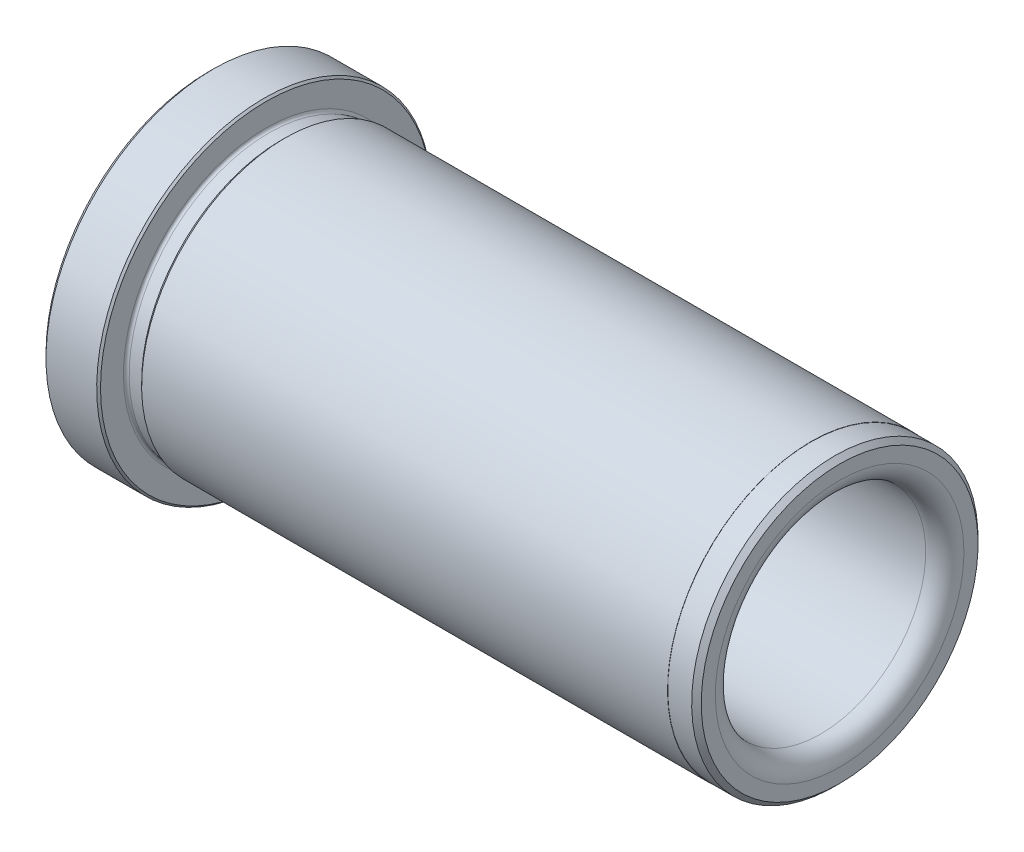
ISO-10303-21;
HEADER;
FILE_DESCRIPTION(('STEP AP214'),'2;1');
FILE_NAME('part.step','',(''),(''),'','','');
FILE_SCHEMA(('AUTOMOTIVE_DESIGN { 1 0 10303 214 1 1 1 1 }'));
ENDSEC;
DATA;
#1=APPLICATION_CONTEXT('core data for automotive mechanical design processes');
#2=APPLICATION_PROTOCOL_DEFINITION('international standard','automotive_design',2000,#1);
#3=PRODUCT_CONTEXT('',#1,'mechanical');
#4=PRODUCT('Part','Part','',(#3));
#5=PRODUCT_RELATED_PRODUCT_CATEGORY('part','',(#4));
#6=PRODUCT_DEFINITION_FORMATION('','',#4);
#7=PRODUCT_DEFINITION_CONTEXT('part definition',#1,'design');
#8=PRODUCT_DEFINITION('design','',#6,#7);
#9=PRODUCT_DEFINITION_SHAPE('','',#8);
#10=(LENGTH_UNIT() NAMED_UNIT(*) SI_UNIT(.MILLI.,.METRE.));
#11=(NAMED_UNIT(*) PLANE_ANGLE_UNIT() SI_UNIT($,.RADIAN.));
#12=(NAMED_UNIT(*) SI_UNIT($,.STERADIAN.) SOLID_ANGLE_UNIT());
#13=UNCERTAINTY_MEASURE_WITH_UNIT(LENGTH_MEASURE(1.E-05),#10,'distance_accuracy_value','');
#14=(GEOMETRIC_REPRESENTATION_CONTEXT(3) GLOBAL_UNCERTAINTY_ASSIGNED_CONTEXT((#13)) GLOBAL_UNIT_ASSIGNED_CONTEXT((#10,
#11,#12)) REPRESENTATION_CONTEXT('',''));
#15=CARTESIAN_POINT('',(0.,0.,0.));
#16=DIRECTION('',(0.,0.,1.));
#17=DIRECTION('',(1.,0.,0.));
#18=AXIS2_PLACEMENT_3D('',#15,#16,#17);
#19=CARTESIAN_POINT('',(-26.7,0.,0.));
#20=DIRECTION('',(1.,0.,0.));
#21=DIRECTION('',(0.,1.,0.));
#22=AXIS2_PLACEMENT_3D('',#19,#20,#21);
#23=TOROIDAL_SURFACE('',#22,14.9,0.3);
#24=CARTESIAN_POINT('',(-27.,0.,0.));
#25=DIRECTION('',(1.,0.,0.));
#26=DIRECTION('',(0.,1.,0.));
#27=AXIS2_PLACEMENT_3D('',#24,#25,#26);
#28=CIRCLE('',#27,14.9);
#29=CARTESIAN_POINT('',(-27.,14.9,0.));
#30=VERTEX_POINT('',#29);
#31=EDGE_CURVE('E83',#30,#30,#28,.T.);
#32=ORIENTED_EDGE('',*,*,#31,.T.);
#33=EDGE_LOOP('',(#32));
#34=FACE_BOUND('',#33,.T.);
#35=CARTESIAN_POINT('',(-26.7,0.,0.));
#36=DIRECTION('',(1.,0.,0.));
#37=DIRECTION('',(0.,1.,0.));
#38=AXIS2_PLACEMENT_3D('',#35,#36,#37);
#39=CIRCLE('',#38,14.6);
#40=CARTESIAN_POINT('',(-26.7,14.6,0.));
#41=VERTEX_POINT('',#40);
#42=EDGE_CURVE('E68',#41,#41,#39,.T.);
#43=ORIENTED_EDGE('',*,*,#42,.F.);
#44=EDGE_LOOP('',(#43));
#45=FACE_BOUND('',#44,.T.);
#46=ADVANCED_FACE('F30',(#34,#45),#23,.F.);
#47=CARTESIAN_POINT('',(33.,0.,0.));
#48=DIRECTION('',(1.,0.,0.));
#49=DIRECTION('',(0.,1.,0.));
#50=AXIS2_PLACEMENT_3D('',#47,#48,#49);
#51=CYLINDRICAL_SURFACE('',#50,14.6);
#52=ORIENTED_EDGE('',*,*,#42,.T.);
#53=EDGE_LOOP('',(#52));
#54=FACE_BOUND('',#53,.T.);
#55=CARTESIAN_POINT('',(-25.4,0.,0.));
#56=DIRECTION('',(1.,0.,0.));
#57=DIRECTION('',(0.,1.,0.));
#58=AXIS2_PLACEMENT_3D('',#55,#56,#57);
#59=CIRCLE('',#58,14.6);
#60=CARTESIAN_POINT('',(-25.4,14.6,0.));
#61=VERTEX_POINT('',#60);
#62=EDGE_CURVE('E71',#61,#61,#59,.T.);
#63=ORIENTED_EDGE('',*,*,#62,.F.);
#64=EDGE_LOOP('',(#63));
#65=FACE_BOUND('',#64,.T.);
#66=ADVANCED_FACE('F104',(#54,#65),#51,.T.);
#67=CARTESIAN_POINT('',(-25.,0.,0.));
#68=DIRECTION('',(1.,0.,0.));
#69=DIRECTION('',(0.,1.,0.));
#70=AXIS2_PLACEMENT_3D('',#67,#68,#69);
#71=CONICAL_SURFACE('',#70,15.,0.785398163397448);
#72=ORIENTED_EDGE('',*,*,#62,.T.);
#73=EDGE_LOOP('',(#72));
#74=FACE_BOUND('',#73,.T.);
#75=CARTESIAN_POINT('',(-25.,0.,0.));
#76=DIRECTION('',(1.,0.,0.));
#77=DIRECTION('',(0.,1.,0.));
#78=AXIS2_PLACEMENT_3D('',#75,#76,#77);
#79=CIRCLE('',#78,15.);
#80=CARTESIAN_POINT('',(-25.,15.,0.));
#81=VERTEX_POINT('',#80);
#82=EDGE_CURVE('E74',#81,#81,#79,.T.);
#83=ORIENTED_EDGE('',*,*,#82,.F.);
#84=EDGE_LOOP('',(#83));
#85=FACE_BOUND('',#84,.T.);
#86=ADVANCED_FACE('F109',(#74,#85),#71,.T.);
#87=CARTESIAN_POINT('',(33.,0.,0.));
#88=DIRECTION('',(1.,0.,0.));
#89=DIRECTION('',(0.,1.,0.));
#90=AXIS2_PLACEMENT_3D('',#87,#88,#89);
#91=CYLINDRICAL_SURFACE('',#90,15.);
#92=ORIENTED_EDGE('',*,*,#82,.T.);
#93=EDGE_LOOP('',(#92));
#94=FACE_BOUND('',#93,.T.);
#95=CARTESIAN_POINT('',(30.,0.,0.));
#96=DIRECTION('',(1.,0.,0.));
#97=DIRECTION('',(0.,1.,0.));
#98=AXIS2_PLACEMENT_3D('',#95,#96,#97);
#99=CIRCLE('',#98,15.);
#100=CARTESIAN_POINT('',(30.,15.,0.));
#101=VERTEX_POINT('',#100);
#102=EDGE_CURVE('E77',#101,#101,#99,.T.);
#103=ORIENTED_EDGE('',*,*,#102,.F.);
#104=EDGE_LOOP('',(#103));
#105=FACE_BOUND('',#104,.T.);
#106=ADVANCED_FACE('F156',(#94,#105),#91,.T.);
#107=CARTESIAN_POINT('',(30.,14.975,0.));
#108=DIRECTION('',(1.,0.,0.));
#109=DIRECTION('',(0.,1.,0.));
#110=AXIS2_PLACEMENT_3D('',#107,#108,#109);
#111=PLANE('',#110);
#112=ORIENTED_EDGE('',*,*,#102,.T.);
#113=EDGE_LOOP('',(#112));
#114=FACE_BOUND('',#113,.T.);
#115=CARTESIAN_POINT('',(30.,0.,0.));
#116=DIRECTION('',(1.,0.,0.));
#117=DIRECTION('',(0.,1.,0.));
#118=AXIS2_PLACEMENT_3D('',#115,#116,#117);
#119=CIRCLE('',#118,14.975);
#120=CARTESIAN_POINT('',(30.,14.975,0.));
#121=VERTEX_POINT('',#120);
#122=EDGE_CURVE('E80',#121,#121,#119,.T.);
#123=ORIENTED_EDGE('',*,*,#122,.F.);
#124=EDGE_LOOP('',(#123));
#125=FACE_BOUND('',#124,.T.);
#126=ADVANCED_FACE('F150',(#114,#125),#111,.T.);
#127=CARTESIAN_POINT('',(33.,0.,0.));
#128=DIRECTION('',(1.,0.,0.));
#129=DIRECTION('',(0.,1.,0.));
#130=AXIS2_PLACEMENT_3D('',#127,#128,#129);
#131=CYLINDRICAL_SURFACE('',#130,14.975);
#132=CARTESIAN_POINT('',(32.5,0.,0.));
#133=DIRECTION('',(1.,0.,0.));
#134=DIRECTION('',(0.,1.,0.));
#135=AXIS2_PLACEMENT_3D('',#132,#133,#134);
#136=CIRCLE('',#135,14.975);
#137=CARTESIAN_POINT('',(32.5,14.975,0.));
#138=VERTEX_POINT('',#137);
#139=EDGE_CURVE('E41',#138,#138,#136,.F.);
#140=ORIENTED_EDGE('',*,*,#139,.T.);
#141=EDGE_LOOP('',(#140));
#142=FACE_BOUND('',#141,.T.);
#143=ORIENTED_EDGE('',*,*,#122,.T.);
#144=EDGE_LOOP('',(#143));
#145=FACE_BOUND('',#144,.T.);
#146=ADVANCED_FACE('F138',(#142,#145),#131,.T.);
#147=CARTESIAN_POINT('',(33.,14.975,0.));
#148=DIRECTION('',(1.,0.,0.));
#149=DIRECTION('',(0.,1.,0.));
#150=AXIS2_PLACEMENT_3D('',#147,#148,#149);
#151=PLANE('',#150);
#152=CARTESIAN_POINT('',(33.,0.,0.));
#153=DIRECTION('',(1.,0.,0.));
#154=DIRECTION('',(0.,1.,0.));
#155=AXIS2_PLACEMENT_3D('',#152,#153,#154);
#156=CIRCLE('',#155,14.475);
#157=CARTESIAN_POINT('',(33.,14.475,0.));
#158=VERTEX_POINT('',#157);
#159=EDGE_CURVE('E45',#158,#158,#156,.T.);
#160=ORIENTED_EDGE('',*,*,#159,.T.);
#161=EDGE_LOOP('',(#160));
#162=FACE_BOUND('',#161,.T.);
#163=CARTESIAN_POINT('',(33.,0.,0.));
#164=DIRECTION('',(1.,0.,0.));
#165=DIRECTION('',(0.,1.,0.));
#166=AXIS2_PLACEMENT_3D('',#163,#164,#165);
#167=CIRCLE('',#166,13.);
#168=CARTESIAN_POINT('',(33.,13.,0.));
#169=VERTEX_POINT('',#168);
#170=EDGE_CURVE('E62',#169,#169,#167,.F.);
#171=ORIENTED_EDGE('',*,*,#170,.T.);
#172=EDGE_LOOP('',(#171));
#173=FACE_BOUND('',#172,.T.);
#174=ADVANCED_FACE('F135',(#162,#173),#151,.T.);
#175=CARTESIAN_POINT('',(-33.,17.5,0.));
#176=DIRECTION('',(-1.,0.,0.));
#177=DIRECTION('',(0.,-1.,0.));
#178=AXIS2_PLACEMENT_3D('',#175,#176,#177);
#179=PLANE('',#178);
#180=CARTESIAN_POINT('',(-33.,0.,0.));
#181=DIRECTION('',(-1.,0.,0.));
#182=DIRECTION('',(0.,-1.,0.));
#183=AXIS2_PLACEMENT_3D('',#180,#181,#182);
#184=CIRCLE('',#183,11.5);
#185=CARTESIAN_POINT('',(-33.,-11.5,0.));
#186=VERTEX_POINT('',#185);
#187=EDGE_CURVE('E53',#186,#186,#184,.F.);
#188=ORIENTED_EDGE('',*,*,#187,.T.);
#189=EDGE_LOOP('',(#188));
#190=FACE_BOUND('',#189,.T.);
#191=CARTESIAN_POINT('',(-33.,0.,0.));
#192=DIRECTION('',(-1.,0.,0.));
#193=DIRECTION('',(0.,-1.,0.));
#194=AXIS2_PLACEMENT_3D('',#191,#192,#193);
#195=CIRCLE('',#194,17.);
#196=CARTESIAN_POINT('',(-33.,-17.,0.));
#197=VERTEX_POINT('',#196);
#198=EDGE_CURVE('E56',#197,#197,#195,.T.);
#199=ORIENTED_EDGE('',*,*,#198,.T.);
#200=EDGE_LOOP('',(#199));
#201=FACE_BOUND('',#200,.T.);
#202=ADVANCED_FACE('F101',(#190,#201),#179,.T.);
#203=CARTESIAN_POINT('',(33.,0.,0.));
#204=DIRECTION('',(1.,0.,0.));
#205=DIRECTION('',(0.,1.,0.));
#206=AXIS2_PLACEMENT_3D('',#203,#204,#205);
#207=CYLINDRICAL_SURFACE('',#206,17.5);
#208=CARTESIAN_POINT('',(-27.2,0.,0.));
#209=DIRECTION('',(1.,0.,0.));
#210=DIRECTION('',(0.,1.,0.));
#211=AXIS2_PLACEMENT_3D('',#208,#209,#210);
#212=CIRCLE('',#211,17.5);
#213=CARTESIAN_POINT('',(-27.2,17.5,0.));
#214=VERTEX_POINT('',#213);
#215=EDGE_CURVE('E11',#214,#214,#212,.F.);
#216=ORIENTED_EDGE('',*,*,#215,.T.);
#217=EDGE_LOOP('',(#216));
#218=FACE_BOUND('',#217,.T.);
#219=CARTESIAN_POINT('',(-32.5,0.,0.));
#220=DIRECTION('',(-1.,0.,0.));
#221=DIRECTION('',(0.,-1.,0.));
#222=AXIS2_PLACEMENT_3D('',#219,#220,#221);
#223=CIRCLE('',#222,17.5);
#224=CARTESIAN_POINT('',(-32.5,-17.5,0.));
#225=VERTEX_POINT('',#224);
#226=EDGE_CURVE('E50',#225,#225,#223,.F.);
#227=ORIENTED_EDGE('',*,*,#226,.T.);
#228=EDGE_LOOP('',(#227));
#229=FACE_BOUND('',#228,.T.);
#230=ADVANCED_FACE('F92',(#218,#229),#207,.T.);
#231=CARTESIAN_POINT('',(-27.,17.5,0.));
#232=DIRECTION('',(1.,0.,0.));
#233=DIRECTION('',(0.,1.,0.));
#234=AXIS2_PLACEMENT_3D('',#231,#232,#233);
#235=PLANE('',#234);
#236=CARTESIAN_POINT('',(-27.,0.,0.));
#237=DIRECTION('',(1.,0.,0.));
#238=DIRECTION('',(0.,1.,0.));
#239=AXIS2_PLACEMENT_3D('',#236,#237,#238);
#240=CIRCLE('',#239,17.3);
#241=CARTESIAN_POINT('',(-27.,17.3,0.));
#242=VERTEX_POINT('',#241);
#243=EDGE_CURVE('E37',#242,#242,#240,.T.);
#244=ORIENTED_EDGE('',*,*,#243,.T.);
#245=EDGE_LOOP('',(#244));
#246=FACE_BOUND('',#245,.T.);
#247=ORIENTED_EDGE('',*,*,#31,.F.);
#248=EDGE_LOOP('',(#247));
#249=FACE_BOUND('',#248,.T.);
#250=ADVANCED_FACE('F89',(#246,#249),#235,.T.);
#251=CARTESIAN_POINT('',(-43.,0.,0.));
#252=DIRECTION('',(1.,0.,0.));
#253=DIRECTION('',(0.,1.,0.));
#254=AXIS2_PLACEMENT_3D('',#251,#252,#253);
#255=CYLINDRICAL_SURFACE('',#254,11.);
#256=CARTESIAN_POINT('',(-32.5,0.,0.));
#257=DIRECTION('',(-1.,0.,0.));
#258=DIRECTION('',(0.,-1.,0.));
#259=AXIS2_PLACEMENT_3D('',#256,#257,#258);
#260=CIRCLE('',#259,11.);
#261=CARTESIAN_POINT('',(-32.5,-11.,0.));
#262=VERTEX_POINT('',#261);
#263=EDGE_CURVE('E59',#262,#262,#260,.T.);
#264=ORIENTED_EDGE('',*,*,#263,.T.);
#265=EDGE_LOOP('',(#264));
#266=FACE_BOUND('',#265,.T.);
#267=CARTESIAN_POINT('',(31.,0.,0.));
#268=DIRECTION('',(1.,0.,0.));
#269=DIRECTION('',(0.,1.,0.));
#270=AXIS2_PLACEMENT_3D('',#267,#268,#269);
#271=CIRCLE('',#270,11.);
#272=CARTESIAN_POINT('',(31.,11.,0.));
#273=VERTEX_POINT('',#272);
#274=EDGE_CURVE('E65',#273,#273,#271,.T.);
#275=ORIENTED_EDGE('',*,*,#274,.T.);
#276=EDGE_LOOP('',(#275));
#277=FACE_BOUND('',#276,.T.);
#278=ADVANCED_FACE('F91',(#266,#277),#255,.F.);
#279=CARTESIAN_POINT('',(31.,0.,0.));
#280=DIRECTION('',(1.,0.,0.));
#281=DIRECTION('',(0.,1.,0.));
#282=AXIS2_PLACEMENT_3D('',#279,#280,#281);
#283=TOROIDAL_SURFACE('',#282,13.,2.);
#284=ORIENTED_EDGE('',*,*,#170,.F.);
#285=EDGE_LOOP('',(#284));
#286=FACE_BOUND('',#285,.T.);
#287=ORIENTED_EDGE('',*,*,#274,.F.);
#288=EDGE_LOOP('',(#287));
#289=FACE_BOUND('',#288,.T.);
#290=ADVANCED_FACE('F98',(#286,#289),#283,.T.);
#291=CARTESIAN_POINT('',(-32.5,0.,0.));
#292=DIRECTION('',(-1.,0.,0.));
#293=DIRECTION('',(0.,-1.,0.));
#294=AXIS2_PLACEMENT_3D('',#291,#292,#293);
#295=CONICAL_SURFACE('',#294,11.,0.78539816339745);
#296=ORIENTED_EDGE('',*,*,#187,.F.);
#297=EDGE_LOOP('',(#296));
#298=FACE_BOUND('',#297,.T.);
#299=ORIENTED_EDGE('',*,*,#263,.F.);
#300=EDGE_LOOP('',(#299));
#301=FACE_BOUND('',#300,.T.);
#302=ADVANCED_FACE('F116',(#298,#301),#295,.F.);
#303=CARTESIAN_POINT('',(-32.5,0.,0.));
#304=DIRECTION('',(1.,0.,0.));
#305=DIRECTION('',(0.,1.,0.));
#306=AXIS2_PLACEMENT_3D('',#303,#304,#305);
#307=CONICAL_SURFACE('',#306,17.5,0.785398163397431);
#308=ORIENTED_EDGE('',*,*,#198,.F.);
#309=EDGE_LOOP('',(#308));
#310=FACE_BOUND('',#309,.T.);
#311=ORIENTED_EDGE('',*,*,#226,.F.);
#312=EDGE_LOOP('',(#311));
#313=FACE_BOUND('',#312,.T.);
#314=ADVANCED_FACE('F120',(#310,#313),#307,.T.);
#315=CARTESIAN_POINT('',(33.,0.,0.));
#316=DIRECTION('',(-1.,0.,0.));
#317=DIRECTION('',(0.,-1.,0.));
#318=AXIS2_PLACEMENT_3D('',#315,#316,#317);
#319=CONICAL_SURFACE('',#318,14.475,0.785398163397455);
#320=ORIENTED_EDGE('',*,*,#139,.F.);
#321=EDGE_LOOP('',(#320));
#322=FACE_BOUND('',#321,.T.);
#323=ORIENTED_EDGE('',*,*,#159,.F.);
#324=EDGE_LOOP('',(#323));
#325=FACE_BOUND('',#324,.T.);
#326=ADVANCED_FACE('F123',(#322,#325),#319,.T.);
#327=CARTESIAN_POINT('',(-27.,0.,0.));
#328=DIRECTION('',(-1.,0.,0.));
#329=DIRECTION('',(0.,-1.,0.));
#330=AXIS2_PLACEMENT_3D('',#327,#328,#329);
#331=CONICAL_SURFACE('',#330,17.3,0.785398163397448);
#332=ORIENTED_EDGE('',*,*,#215,.F.);
#333=EDGE_LOOP('',(#332));
#334=FACE_BOUND('',#333,.T.);
#335=ORIENTED_EDGE('',*,*,#243,.F.);
#336=EDGE_LOOP('',(#335));
#337=FACE_BOUND('',#336,.T.);
#338=ADVANCED_FACE('F32',(#334,#337),#331,.T.);
#339=CLOSED_SHELL('',(#46,#66,#86,#106,#126,#146,#174,#202,#230,#250,#278,#290,#302,#314,#326,#338));
#340=MANIFOLD_SOLID_BREP('B2',#339);
#341=ADVANCED_BREP_SHAPE_REPRESENTATION('',(#18,#340),#14);
#342=SHAPE_DEFINITION_REPRESENTATION(#9,#341);
ENDSEC;
END-ISO-10303-21;
